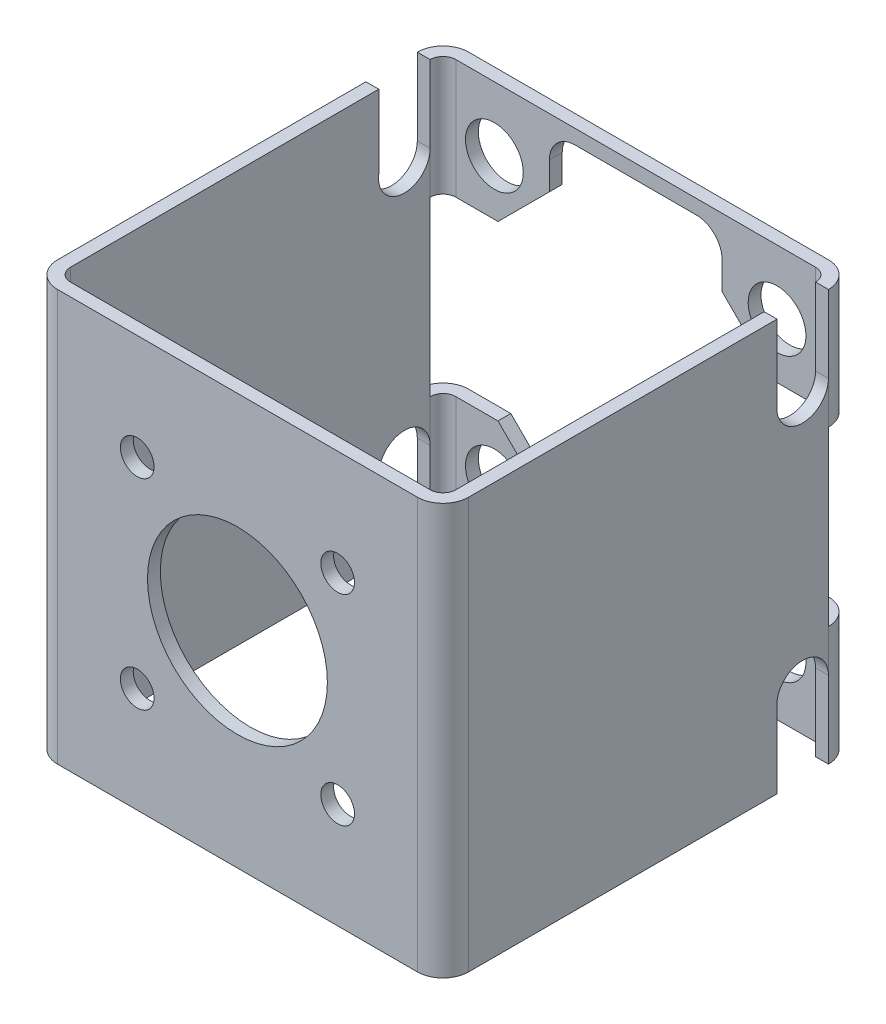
from build123d import *

# Parameters (mm, degrees)
F_4_X_4_X_4_DEPTH         = 50.8
F_4_X_4_X_4_DEPTH_BACK    = 50.8
SKETCH2_W                 = 101.6
SKETCH2_H                 = 101.6
SKETCH2_W_2               = 95.25
SKETCH2_H_2               = 95.25
FILLET1_R                 = 6.35
FILLET2_R                 = 3.175
F_1_75_OD_REACH           = 126.434
SKETCH3_R                 = 22.225
CUT_EXTRUDE_4_328_REACH   = 126.434
SKETCH4_R                 = 4.1656
F_1_68_CUTOUTS_DEPTH      = 15.875
F_5_X_45DEG_REACH         = 126.434
FILLET_R_25_R             = 6.35
CUT_EXTRUDE_4_562_REACH   = 126.434
SKETCH7_R                 = 7.1374
SKETCH8_W                 = 104.173202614
SKETCH8_H                 = 42.672
SIDE_CUTOUTS_DEPTH        = 6.35
WRENCH_CUTOUTS_DEPTH      = 88.988181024
WRENCH_CUTOUTS_DEPTH_BACK = 88.988181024


with BuildPart() as part:
    # Sketch2 → 4 X 4 X 4 (new, two sides: drawn at the far end of the back side and taken through both)
    with BuildSketch(Plane(origin=(0, 0, 0), x_dir=(1, 0, 0), z_dir=(0, 1, 0)).offset(-F_4_X_4_X_4_DEPTH_BACK)):
        Rectangle(SKETCH2_W, SKETCH2_H)
        Rectangle(SKETCH2_W_2, SKETCH2_H_2, mode=Mode.SUBTRACT)
    extrude(amount=F_4_X_4_X_4_DEPTH + F_4_X_4_X_4_DEPTH_BACK)

    # Fillet1
    fillet1_edges = [part.edges().sort_by_distance(p)[0] for p in [
        (-50.8, 0, -50.8),
        (50.8, 0, -50.8),
        (50.8, 0, 50.8),
        (-50.8, 0, 50.8),
    ]]
    fillet(fillet1_edges, radius=FILLET1_R)

    # Fillet2
    fillet2_edges = [part.edges().sort_by_distance(p)[0] for p in [
        (-47.625, 0, -47.625),
        (-47.625, 0, 47.625),
        (47.625, 0, 47.625),
        (47.625, 0, -47.625),
    ]]
    fillet(fillet2_edges, radius=FILLET2_R)

    # Sketch3 → 1.75 OD (cut, up to next)
    with BuildSketch(Plane.XY.offset(50.8), mode=Mode.PRIVATE) as f_1_75_od_sk1:
        Circle(SKETCH3_R)
    f_1_75_od_tool1 = extrude(f_1_75_od_sk1.sketch, amount=-F_1_75_OD_REACH, mode=Mode.PRIVATE) & part.part
    add(f_1_75_od_tool1.solids().sort_by_distance((0, 0, 50.8))[0], mode=Mode.SUBTRACT)

    # Sketch4 → Cut-Extrude 4_ .328 (cut, up to next)
    with BuildSketch(Plane.XY.offset(50.8), mode=Mode.PRIVATE) as cut_extrude_4_328_sk1:
        with Locations((-24.765, 24.765)):
            Circle(SKETCH4_R)
    cut_extrude_4_328_tool1 = extrude(cut_extrude_4_328_sk1.sketch, amount=-CUT_EXTRUDE_4_328_REACH, mode=Mode.PRIVATE) & part.part
    # Sketch4 → Cut-Extrude 4_ .328 (cut, up to next)
    with BuildSketch(Plane.XY.offset(50.8), mode=Mode.PRIVATE) as cut_extrude_4_328_sk2:
        with Locations((24.765, 24.765)):
            Circle(SKETCH4_R)
    cut_extrude_4_328_tool2 = extrude(cut_extrude_4_328_sk2.sketch, amount=-CUT_EXTRUDE_4_328_REACH, mode=Mode.PRIVATE) & part.part
    # Sketch4 → Cut-Extrude 4_ .328 (cut, up to next)
    with BuildSketch(Plane.XY.offset(50.8), mode=Mode.PRIVATE) as cut_extrude_4_328_sk3:
        with Locations((24.765, -24.765)):
            Circle(SKETCH4_R)
    cut_extrude_4_328_tool3 = extrude(cut_extrude_4_328_sk3.sketch, amount=-CUT_EXTRUDE_4_328_REACH, mode=Mode.PRIVATE) & part.part
    # Sketch4 → Cut-Extrude 4_ .328 (cut, up to next)
    with BuildSketch(Plane.XY.offset(50.8), mode=Mode.PRIVATE) as cut_extrude_4_328_sk4:
        with Locations((-24.765, -24.765)):
            Circle(SKETCH4_R)
    cut_extrude_4_328_tool4 = extrude(cut_extrude_4_328_sk4.sketch, amount=-CUT_EXTRUDE_4_328_REACH, mode=Mode.PRIVATE) & part.part
    add(cut_extrude_4_328_tool1.solids().sort_by_distance((-24.765, 24.765, 50.8))[0], mode=Mode.SUBTRACT)
    add(cut_extrude_4_328_tool2.solids().sort_by_distance((24.765, 24.765, 50.8))[0], mode=Mode.SUBTRACT)
    add(cut_extrude_4_328_tool3.solids().sort_by_distance((24.765, -24.765, 50.8))[0], mode=Mode.SUBTRACT)
    add(cut_extrude_4_328_tool4.solids().sort_by_distance((-24.765, -24.765, 50.8))[0], mode=Mode.SUBTRACT)

    # Sketch5 → 1.68 CUTOUTS (cut)
    with BuildSketch(Plane(origin=(0, 0, -50.8), x_dir=(-1, 0, 0), z_dir=(0, 0, -1))):
        Polygon((-44.45, 21.336), (-21.336, 21.336), (-21.336, 47.244), (21.336, 47.244), (21.336, 21.336), (44.45, 21.336), (44.45, -21.336), (21.336, -21.336), (21.336, -47.244), (-21.336, -47.244), (-21.336, -21.336), (-44.45, -21.336), align=None)
    extrude(amount=-F_1_68_CUTOUTS_DEPTH, mode=Mode.SUBTRACT)

    # Sketch6 → 5 X 45DEG (cut, up to next)
    with BuildSketch(Plane(origin=(0, 0, -50.8), x_dir=(-1, 0, 0), z_dir=(0, 0, -1)), mode=Mode.PRIVATE) as f_5_x_45deg_sk1:
        Polygon((21.336, -34.036), (34.036, -21.336), (17.978558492, -16.469868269), align=None)
    f_5_x_45deg_tool1 = extrude(f_5_x_45deg_sk1.sketch, amount=-F_5_X_45DEG_REACH, mode=Mode.PRIVATE) & part.part
    # Sketch6 → 5 X 45DEG (cut, up to next)
    with BuildSketch(Plane(origin=(0, 0, -50.8), x_dir=(-1, 0, 0), z_dir=(0, 0, -1)), mode=Mode.PRIVATE) as f_5_x_45deg_sk2:
        Polygon((-17.978558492, -16.469868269), (-34.036, -21.336), (-21.336, -34.036), align=None)
    f_5_x_45deg_tool2 = extrude(f_5_x_45deg_sk2.sketch, amount=-F_5_X_45DEG_REACH, mode=Mode.PRIVATE) & part.part
    # Sketch6 → 5 X 45DEG (cut, up to next)
    with BuildSketch(Plane(origin=(0, 0, -50.8), x_dir=(-1, 0, 0), z_dir=(0, 0, -1)), mode=Mode.PRIVATE) as f_5_x_45deg_sk3:
        Polygon((-21.336, 34.036), (-34.036, 21.336), (-17.978558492, 16.469868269), align=None)
    f_5_x_45deg_tool3 = extrude(f_5_x_45deg_sk3.sketch, amount=-F_5_X_45DEG_REACH, mode=Mode.PRIVATE) & part.part
    # Sketch6 → 5 X 45DEG (cut, up to next)
    with BuildSketch(Plane(origin=(0, 0, -50.8), x_dir=(-1, 0, 0), z_dir=(0, 0, -1)), mode=Mode.PRIVATE) as f_5_x_45deg_sk4:
        Polygon((17.978558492, 16.469868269), (34.036, 21.336), (21.336, 34.036), align=None)
    f_5_x_45deg_tool4 = extrude(f_5_x_45deg_sk4.sketch, amount=-F_5_X_45DEG_REACH, mode=Mode.PRIVATE) & part.part
    add(f_5_x_45deg_tool1.solids().sort_by_distance((-24.450186, -23.947289, -50.8))[0], mode=Mode.SUBTRACT)
    add(f_5_x_45deg_tool2.solids().sort_by_distance((24.450186, -23.947289, -50.8))[0], mode=Mode.SUBTRACT)
    add(f_5_x_45deg_tool3.solids().sort_by_distance((24.450186, 23.947289, -50.8))[0], mode=Mode.SUBTRACT)
    add(f_5_x_45deg_tool4.solids().sort_by_distance((-24.450186, 23.947289, -50.8))[0], mode=Mode.SUBTRACT)

    # Fillet R.25
    fillet_r_25_edges = [part.edges().sort_by_distance(p)[0] for p in [
        (21.336, 47.244, -49.2125),
        (-21.336, 47.244, -49.2125),
        (-21.336, -47.244, -49.2125),
        (21.336, -47.244, -49.2125),
    ]]
    fillet(fillet_r_25_edges, radius=FILLET_R_25_R)

    # Sketch7 → Cut-Extrude 4_ .562 (cut, up to next)
    with BuildSketch(Plane(origin=(0, 0, -50.8), x_dir=(-1, 0, 0), z_dir=(0, 0, -1)), mode=Mode.PRIVATE) as cut_extrude_4_562_sk1:
        with Locations((34.925, 34.925)):
            Circle(SKETCH7_R)
    cut_extrude_4_562_tool1 = extrude(cut_extrude_4_562_sk1.sketch, amount=-CUT_EXTRUDE_4_562_REACH, mode=Mode.PRIVATE) & part.part
    # Sketch7 → Cut-Extrude 4_ .562 (cut, up to next)
    with BuildSketch(Plane(origin=(0, 0, -50.8), x_dir=(-1, 0, 0), z_dir=(0, 0, -1)), mode=Mode.PRIVATE) as cut_extrude_4_562_sk2:
        with Locations((34.925, -34.925)):
            Circle(SKETCH7_R)
    cut_extrude_4_562_tool2 = extrude(cut_extrude_4_562_sk2.sketch, amount=-CUT_EXTRUDE_4_562_REACH, mode=Mode.PRIVATE) & part.part
    # Sketch7 → Cut-Extrude 4_ .562 (cut, up to next)
    with BuildSketch(Plane(origin=(0, 0, -50.8), x_dir=(-1, 0, 0), z_dir=(0, 0, -1)), mode=Mode.PRIVATE) as cut_extrude_4_562_sk3:
        with Locations((-34.925, -34.925)):
            Circle(SKETCH7_R)
    cut_extrude_4_562_tool3 = extrude(cut_extrude_4_562_sk3.sketch, amount=-CUT_EXTRUDE_4_562_REACH, mode=Mode.PRIVATE) & part.part
    # Sketch7 → Cut-Extrude 4_ .562 (cut, up to next)
    with BuildSketch(Plane(origin=(0, 0, -50.8), x_dir=(-1, 0, 0), z_dir=(0, 0, -1)), mode=Mode.PRIVATE) as cut_extrude_4_562_sk4:
        with Locations((-34.925, 34.925)):
            Circle(SKETCH7_R)
    cut_extrude_4_562_tool4 = extrude(cut_extrude_4_562_sk4.sketch, amount=-CUT_EXTRUDE_4_562_REACH, mode=Mode.PRIVATE) & part.part
    add(cut_extrude_4_562_tool1.solids().sort_by_distance((-34.925, 34.925, -50.8))[0], mode=Mode.SUBTRACT)
    add(cut_extrude_4_562_tool2.solids().sort_by_distance((-34.925, -34.925, -50.8))[0], mode=Mode.SUBTRACT)
    add(cut_extrude_4_562_tool3.solids().sort_by_distance((34.925, -34.925, -50.8))[0], mode=Mode.SUBTRACT)
    add(cut_extrude_4_562_tool4.solids().sort_by_distance((34.925, 34.925, -50.8))[0], mode=Mode.SUBTRACT)

    # Sketch8 → SIDE CUTOUTS (cut)
    with BuildSketch(Plane(origin=(0, 0, -50.8), x_dir=(-1, 0, 0), z_dir=(0, 0, -1))):
        Rectangle(SKETCH8_W, SKETCH8_H)
    extrude(amount=-SIDE_CUTOUTS_DEPTH, mode=Mode.SUBTRACT)

    # Sketch9 → WRENCH CUTOUTS (cut, two sides: drawn at the far end of the back side and taken through both)
    with BuildSketch(Plane(origin=(0, 0, 0), x_dir=(0, 0, -1), z_dir=(1, 0, 0)).offset(-WRENCH_CUTOUTS_DEPTH_BACK)):
        with BuildLine():
            Line((31.75, 50.8), (44.45, 50.8))
            Line((44.45, 50.8), (44.45, 31.775486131))
            ThreePointArc((44.45, 31.775486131), (37.671417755, 25.412755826), (31.75, 32.580065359))
            Line((31.75, 32.580065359), (31.75, 50.8))
        make_face()
        with BuildLine():
            Line((44.45, -50.8), (44.45, -31.775486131))
            ThreePointArc((44.45, -31.775486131), (37.671417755, -25.412755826), (31.75, -32.580065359))
            Line((31.75, -32.580065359), (31.75, -50.8))
            Line((31.75, -50.8), (44.45, -50.8))
        make_face()
    extrude(amount=WRENCH_CUTOUTS_DEPTH + WRENCH_CUTOUTS_DEPTH_BACK, mode=Mode.SUBTRACT)


solid = part.part
